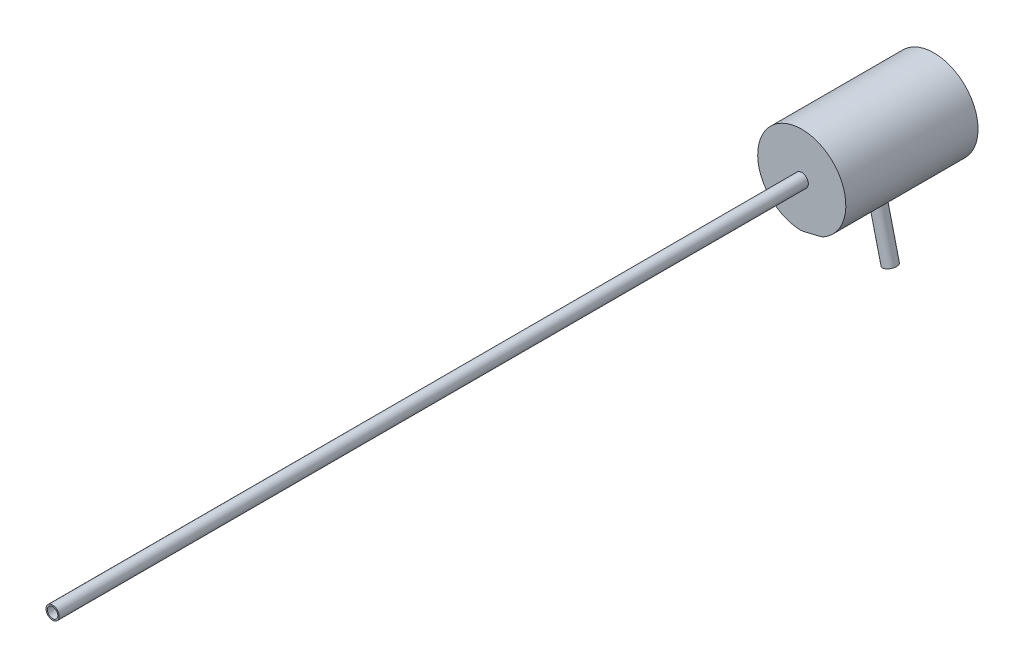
ISO-10303-21;
HEADER;
FILE_DESCRIPTION(('STEP AP214'),'2;1');
FILE_NAME('part.step','',(''),(''),'','','');
FILE_SCHEMA(('AUTOMOTIVE_DESIGN { 1 0 10303 214 1 1 1 1 }'));
ENDSEC;
DATA;
#1=APPLICATION_CONTEXT('core data for automotive mechanical design processes');
#2=APPLICATION_PROTOCOL_DEFINITION('international standard','automotive_design',2000,#1);
#3=PRODUCT_CONTEXT('',#1,'mechanical');
#4=PRODUCT('Part','Part','',(#3));
#5=PRODUCT_RELATED_PRODUCT_CATEGORY('part','',(#4));
#6=PRODUCT_DEFINITION_FORMATION('','',#4);
#7=PRODUCT_DEFINITION_CONTEXT('part definition',#1,'design');
#8=PRODUCT_DEFINITION('design','',#6,#7);
#9=PRODUCT_DEFINITION_SHAPE('','',#8);
#10=(LENGTH_UNIT() NAMED_UNIT(*) SI_UNIT(.MILLI.,.METRE.));
#11=(NAMED_UNIT(*) PLANE_ANGLE_UNIT() SI_UNIT($,.RADIAN.));
#12=(NAMED_UNIT(*) SI_UNIT($,.STERADIAN.) SOLID_ANGLE_UNIT());
#13=UNCERTAINTY_MEASURE_WITH_UNIT(LENGTH_MEASURE(1.E-05),#10,'distance_accuracy_value','');
#14=(GEOMETRIC_REPRESENTATION_CONTEXT(3) GLOBAL_UNCERTAINTY_ASSIGNED_CONTEXT((#13)) GLOBAL_UNIT_ASSIGNED_CONTEXT((#10,
#11,#12)) REPRESENTATION_CONTEXT('',''));
#15=CARTESIAN_POINT('',(0.,0.,0.));
#16=DIRECTION('',(0.,0.,1.));
#17=DIRECTION('',(1.,0.,0.));
#18=AXIS2_PLACEMENT_3D('',#15,#16,#17);
#19=CARTESIAN_POINT('',(0.,-12.7,101.6));
#20=DIRECTION('',(-0.234935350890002,0.972010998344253,0.));
#21=DIRECTION('',(-0.972010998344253,-0.234935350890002,0.));
#22=AXIS2_PLACEMENT_3D('',#19,#20,#21);
#23=PLANE('',#22);
#24=DIRECTION('',(0.972010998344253,0.234935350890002,0.));
#25=VECTOR('',#24,1.);
#26=CARTESIAN_POINT('',(0.,-12.7,0.));
#27=LINE('',#26,#25);
#28=CARTESIAN_POINT('',(0.664361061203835,-12.5394237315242,0.));
#29=VERTEX_POINT('',#28);
#30=CARTESIAN_POINT('',(5.13597646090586,-11.4586329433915,0.));
#31=VERTEX_POINT('',#30);
#32=EDGE_CURVE('E103',#29,#31,#27,.T.);
#33=ORIENTED_EDGE('',*,*,#32,.T.);
#34=DIRECTION('',(0.,0.,-1.));
#35=VECTOR('',#34,1.);
#36=CARTESIAN_POINT('',(5.13597646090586,-11.4586329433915,101.6));
#37=LINE('',#36,#35);
#38=CARTESIAN_POINT('',(5.13597646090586,-11.4586329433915,38.1));
#39=VERTEX_POINT('',#38);
#40=EDGE_CURVE('E52',#31,#39,#37,.F.);
#41=ORIENTED_EDGE('',*,*,#40,.T.);
#42=DIRECTION('',(-0.972010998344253,-0.234935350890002,0.));
#43=VECTOR('',#42,1.);
#44=CARTESIAN_POINT('',(2.90016876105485,-11.9990283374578,38.1));
#45=LINE('',#44,#43);
#46=CARTESIAN_POINT('',(0.664361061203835,-12.5394237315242,38.1));
#47=VERTEX_POINT('',#46);
#48=EDGE_CURVE('E74',#39,#47,#45,.T.);
#49=ORIENTED_EDGE('',*,*,#48,.T.);
#50=DIRECTION('',(0.,0.,-1.));
#51=VECTOR('',#50,1.);
#52=CARTESIAN_POINT('',(0.664361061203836,-12.5394237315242,101.6));
#53=LINE('',#52,#51);
#54=EDGE_CURVE('E97',#47,#29,#53,.T.);
#55=ORIENTED_EDGE('',*,*,#54,.T.);
#56=EDGE_LOOP('',(#33,#41,#49,#55));
#57=FACE_BOUND('',#56,.T.);
#58=CARTESIAN_POINT('',(2.90016876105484,-11.9990283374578,19.1835264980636));
#59=DIRECTION('',(-0.234935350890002,0.972010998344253,0.));
#60=DIRECTION('',(-0.972010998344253,-0.234935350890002,0.));
#61=AXIS2_PLACEMENT_3D('',#58,#59,#60);
#62=CIRCLE('',#61,1.905);
#63=CARTESIAN_POINT('',(1.04848780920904,-12.4465801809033,19.1835264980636));
#64=VERTEX_POINT('',#63);
#65=EDGE_CURVE('E92',#64,#64,#62,.F.);
#66=ORIENTED_EDGE('',*,*,#65,.F.);
#67=EDGE_LOOP('',(#66));
#68=FACE_BOUND('',#67,.T.);
#69=ADVANCED_FACE('F31',(#57,#68),#23,.F.);
#70=CARTESIAN_POINT('',(0.,0.,38.1));
#71=DIRECTION('',(0.,0.,1.));
#72=DIRECTION('',(1.,0.,0.));
#73=AXIS2_PLACEMENT_3D('',#70,#71,#72);
#74=PLANE('',#73);
#75=ORIENTED_EDGE('',*,*,#48,.F.);
#76=CARTESIAN_POINT('',(3.94250487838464,-6.52081707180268,38.1));
#77=DIRECTION('',(0.,0.,1.));
#78=DIRECTION('',(1.,0.,0.));
#79=AXIS2_PLACEMENT_3D('',#76,#77,#78);
#80=CIRCLE('',#79,5.08);
#81=CARTESIAN_POINT('',(6.57084146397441,-10.8680284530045,38.1));
#82=VERTEX_POINT('',#81);
#83=EDGE_CURVE('E11',#39,#82,#80,.T.);
#84=ORIENTED_EDGE('',*,*,#83,.T.);
#85=CARTESIAN_POINT('',(0.,0.,38.1));
#86=DIRECTION('',(0.,0.,1.));
#87=DIRECTION('',(1.,0.,0.));
#88=AXIS2_PLACEMENT_3D('',#85,#86,#87);
#89=CIRCLE('',#88,12.7);
#90=CARTESIAN_POINT('',(-0.881850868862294,-12.6693464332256,38.1));
#91=VERTEX_POINT('',#90);
#92=EDGE_CURVE('E73',#82,#91,#89,.T.);
#93=ORIENTED_EDGE('',*,*,#92,.T.);
#94=CARTESIAN_POINT('',(-0.529110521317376,-7.60160785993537,38.1));
#95=DIRECTION('',(0.,0.,1.));
#96=DIRECTION('',(1.,0.,0.));
#97=AXIS2_PLACEMENT_3D('',#94,#95,#96);
#98=CIRCLE('',#97,5.08);
#99=EDGE_CURVE('E39',#91,#47,#98,.T.);
#100=ORIENTED_EDGE('',*,*,#99,.T.);
#101=EDGE_LOOP('',(#75,#84,#93,#100));
#102=FACE_BOUND('',#101,.T.);
#103=CARTESIAN_POINT('',(0.,0.,38.1));
#104=DIRECTION('',(0.,0.,1.));
#105=DIRECTION('',(1.,0.,0.));
#106=AXIS2_PLACEMENT_3D('',#103,#104,#105);
#107=CIRCLE('',#106,1.905);
#108=CARTESIAN_POINT('',(1.905,0.,38.1));
#109=VERTEX_POINT('',#108);
#110=EDGE_CURVE('E118',#109,#109,#107,.T.);
#111=ORIENTED_EDGE('',*,*,#110,.F.);
#112=EDGE_LOOP('',(#111));
#113=FACE_BOUND('',#112,.T.);
#114=ADVANCED_FACE('F71',(#102,#113),#74,.T.);
#115=CARTESIAN_POINT('',(0.,0.,38.1));
#116=DIRECTION('',(0.,0.,-1.));
#117=DIRECTION('',(-1.,0.,0.));
#118=AXIS2_PLACEMENT_3D('',#115,#116,#117);
#119=CYLINDRICAL_SURFACE('',#118,12.7);
#120=ORIENTED_EDGE('',*,*,#92,.F.);
#121=DIRECTION('',(0.,0.,-1.));
#122=VECTOR('',#121,1.);
#123=CARTESIAN_POINT('',(6.57084146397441,-10.8680284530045,38.1));
#124=LINE('',#123,#122);
#125=CARTESIAN_POINT('',(6.57084146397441,-10.8680284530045,0.));
#126=VERTEX_POINT('',#125);
#127=EDGE_CURVE('E80',#82,#126,#124,.T.);
#128=ORIENTED_EDGE('',*,*,#127,.T.);
#129=CARTESIAN_POINT('',(0.,0.,0.));
#130=DIRECTION('',(0.,0.,1.));
#131=DIRECTION('',(1.,0.,0.));
#132=AXIS2_PLACEMENT_3D('',#129,#130,#131);
#133=CIRCLE('',#132,12.7);
#134=CARTESIAN_POINT('',(-0.881850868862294,-12.6693464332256,0.));
#135=VERTEX_POINT('',#134);
#136=EDGE_CURVE('E85',#126,#135,#133,.T.);
#137=ORIENTED_EDGE('',*,*,#136,.T.);
#138=DIRECTION('',(0.,0.,-1.));
#139=VECTOR('',#138,1.);
#140=CARTESIAN_POINT('',(-0.881850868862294,-12.6693464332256,38.1));
#141=LINE('',#140,#139);
#142=EDGE_CURVE('E83',#135,#91,#141,.F.);
#143=ORIENTED_EDGE('',*,*,#142,.T.);
#144=EDGE_LOOP('',(#120,#128,#137,#143));
#145=FACE_BOUND('',#144,.T.);
#146=ADVANCED_FACE('F33',(#145),#119,.T.);
#147=CARTESIAN_POINT('',(0.,0.,0.));
#148=DIRECTION('',(0.,0.,1.));
#149=DIRECTION('',(1.,0.,0.));
#150=AXIS2_PLACEMENT_3D('',#147,#148,#149);
#151=PLANE('',#150);
#152=ORIENTED_EDGE('',*,*,#136,.F.);
#153=CARTESIAN_POINT('',(3.94250487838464,-6.52081707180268,0.));
#154=DIRECTION('',(0.,0.,1.));
#155=DIRECTION('',(1.,0.,0.));
#156=AXIS2_PLACEMENT_3D('',#153,#154,#155);
#157=CIRCLE('',#156,5.08);
#158=EDGE_CURVE('E88',#126,#31,#157,.F.);
#159=ORIENTED_EDGE('',*,*,#158,.T.);
#160=ORIENTED_EDGE('',*,*,#32,.F.);
#161=CARTESIAN_POINT('',(-0.529110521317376,-7.60160785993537,0.));
#162=DIRECTION('',(0.,0.,1.));
#163=DIRECTION('',(1.,0.,0.));
#164=AXIS2_PLACEMENT_3D('',#161,#162,#163);
#165=CIRCLE('',#164,5.08);
#166=EDGE_CURVE('E89',#29,#135,#165,.F.);
#167=ORIENTED_EDGE('',*,*,#166,.T.);
#168=EDGE_LOOP('',(#152,#159,#160,#167));
#169=FACE_BOUND('',#168,.T.);
#170=ADVANCED_FACE('F106',(#169),#151,.F.);
#171=CARTESIAN_POINT('',(0.,0.,254.));
#172=DIRECTION('',(0.,0.,1.));
#173=DIRECTION('',(1.,0.,0.));
#174=AXIS2_PLACEMENT_3D('',#171,#172,#173);
#175=PLANE('',#174);
#176=CARTESIAN_POINT('',(0.,0.,254.));
#177=DIRECTION('',(0.,0.,1.));
#178=DIRECTION('',(1.,0.,0.));
#179=AXIS2_PLACEMENT_3D('',#176,#177,#178);
#180=CIRCLE('',#179,1.905);
#181=CARTESIAN_POINT('',(1.905,0.,254.));
#182=VERTEX_POINT('',#181);
#183=EDGE_CURVE('E121',#182,#182,#180,.T.);
#184=ORIENTED_EDGE('',*,*,#183,.T.);
#185=EDGE_LOOP('',(#184));
#186=FACE_BOUND('',#185,.T.);
#187=CARTESIAN_POINT('',(0.,0.,254.));
#188=DIRECTION('',(0.,0.,1.));
#189=DIRECTION('',(1.,0.,0.));
#190=AXIS2_PLACEMENT_3D('',#187,#188,#189);
#191=CIRCLE('',#190,1.50374643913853);
#192=CARTESIAN_POINT('',(1.50374643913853,0.,254.));
#193=VERTEX_POINT('',#192);
#194=EDGE_CURVE('E109',#193,#193,#191,.T.);
#195=ORIENTED_EDGE('',*,*,#194,.F.);
#196=EDGE_LOOP('',(#195));
#197=FACE_BOUND('',#196,.T.);
#198=ADVANCED_FACE('F187',(#186,#197),#175,.T.);
#199=CARTESIAN_POINT('',(0.,0.,254.));
#200=DIRECTION('',(0.,0.,-1.));
#201=DIRECTION('',(-1.,0.,0.));
#202=AXIS2_PLACEMENT_3D('',#199,#200,#201);
#203=CYLINDRICAL_SURFACE('',#202,1.905);
#204=ORIENTED_EDGE('',*,*,#183,.F.);
#205=EDGE_LOOP('',(#204));
#206=FACE_BOUND('',#205,.T.);
#207=ORIENTED_EDGE('',*,*,#110,.T.);
#208=EDGE_LOOP('',(#207));
#209=FACE_BOUND('',#208,.T.);
#210=ADVANCED_FACE('F240',(#206,#209),#203,.T.);
#211=CARTESIAN_POINT('',(0.,0.,254.));
#212=DIRECTION('',(0.,0.,-1.));
#213=DIRECTION('',(-1.,0.,0.));
#214=AXIS2_PLACEMENT_3D('',#211,#212,#213);
#215=CYLINDRICAL_SURFACE('',#214,1.50374643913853);
#216=ORIENTED_EDGE('',*,*,#194,.T.);
#217=EDGE_LOOP('',(#216));
#218=FACE_BOUND('',#217,.T.);
#219=CARTESIAN_POINT('',(0.,0.,38.1));
#220=DIRECTION('',(0.,0.,1.));
#221=DIRECTION('',(1.,0.,0.));
#222=AXIS2_PLACEMENT_3D('',#219,#220,#221);
#223=CIRCLE('',#222,1.50374643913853);
#224=CARTESIAN_POINT('',(1.50374643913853,0.,38.1));
#225=VERTEX_POINT('',#224);
#226=EDGE_CURVE('E84',#225,#225,#223,.F.);
#227=ORIENTED_EDGE('',*,*,#226,.T.);
#228=EDGE_LOOP('',(#227));
#229=FACE_BOUND('',#228,.T.);
#230=ADVANCED_FACE('F167',(#218,#229),#215,.F.);
#231=ORIENTED_EDGE('',*,*,#226,.F.);
#232=EDGE_LOOP('',(#231));
#233=FACE_BOUND('',#232,.T.);
#234=ADVANCED_FACE('F136',(#233),#74,.T.);
#235=CARTESIAN_POINT('',(6.59247146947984,-27.2753961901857,19.1835264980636));
#236=DIRECTION('',(0.234935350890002,-0.972010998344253,0.));
#237=DIRECTION('',(0.972010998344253,0.234935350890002,0.));
#238=AXIS2_PLACEMENT_3D('',#235,#236,#237);
#239=PLANE('',#238);
#240=CARTESIAN_POINT('',(6.59247146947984,-27.2753961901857,19.1835264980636));
#241=DIRECTION('',(0.234935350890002,-0.972010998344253,0.));
#242=DIRECTION('',(0.972010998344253,0.234935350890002,0.));
#243=AXIS2_PLACEMENT_3D('',#240,#241,#242);
#244=CIRCLE('',#243,1.905);
#245=CARTESIAN_POINT('',(8.44415242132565,-26.8278443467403,19.1835264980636));
#246=VERTEX_POINT('',#245);
#247=EDGE_CURVE('E107',#246,#246,#244,.T.);
#248=ORIENTED_EDGE('',*,*,#247,.T.);
#249=EDGE_LOOP('',(#248));
#250=FACE_BOUND('',#249,.T.);
#251=CARTESIAN_POINT('',(6.59247146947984,-27.2753961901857,19.1835264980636));
#252=DIRECTION('',(0.234935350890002,-0.972010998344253,0.));
#253=DIRECTION('',(0.972010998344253,0.234935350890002,0.));
#254=AXIS2_PLACEMENT_3D('',#251,#252,#253);
#255=CIRCLE('',#254,1.53595750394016);
#256=CARTESIAN_POINT('',(8.08543905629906,-26.9145454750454,19.1835264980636));
#257=VERTEX_POINT('',#256);
#258=EDGE_CURVE('E112',#257,#257,#255,.T.);
#259=ORIENTED_EDGE('',*,*,#258,.F.);
#260=EDGE_LOOP('',(#259));
#261=FACE_BOUND('',#260,.T.);
#262=ADVANCED_FACE('F158',(#250,#261),#239,.T.);
#263=CARTESIAN_POINT('',(6.59247146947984,-27.2753961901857,19.1835264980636));
#264=DIRECTION('',(-0.234935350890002,0.972010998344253,0.));
#265=DIRECTION('',(-0.972010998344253,-0.234935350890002,0.));
#266=AXIS2_PLACEMENT_3D('',#263,#264,#265);
#267=CYLINDRICAL_SURFACE('',#266,1.905);
#268=ORIENTED_EDGE('',*,*,#247,.F.);
#269=EDGE_LOOP('',(#268));
#270=FACE_BOUND('',#269,.T.);
#271=ORIENTED_EDGE('',*,*,#65,.T.);
#272=EDGE_LOOP('',(#271));
#273=FACE_BOUND('',#272,.T.);
#274=ADVANCED_FACE('F129',(#270,#273),#267,.T.);
#275=CARTESIAN_POINT('',(6.59247146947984,-27.2753961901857,19.1835264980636));
#276=DIRECTION('',(-0.234935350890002,0.972010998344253,0.));
#277=DIRECTION('',(-0.972010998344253,-0.234935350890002,0.));
#278=AXIS2_PLACEMENT_3D('',#275,#276,#277);
#279=CYLINDRICAL_SURFACE('',#278,1.53595750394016);
#280=ORIENTED_EDGE('',*,*,#258,.T.);
#281=EDGE_LOOP('',(#280));
#282=FACE_BOUND('',#281,.T.);
#283=CARTESIAN_POINT('',(2.90016876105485,-11.9990283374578,19.1835264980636));
#284=DIRECTION('',(0.234935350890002,-0.972010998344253,0.));
#285=DIRECTION('',(0.972010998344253,0.234935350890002,0.));
#286=AXIS2_PLACEMENT_3D('',#283,#284,#285);
#287=CIRCLE('',#286,1.53595750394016);
#288=CARTESIAN_POINT('',(4.39313634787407,-11.6381776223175,19.1835264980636));
#289=VERTEX_POINT('',#288);
#290=EDGE_CURVE('E152',#289,#289,#287,.T.);
#291=ORIENTED_EDGE('',*,*,#290,.F.);
#292=EDGE_LOOP('',(#291));
#293=FACE_BOUND('',#292,.T.);
#294=ADVANCED_FACE('F140',(#282,#293),#279,.F.);
#295=ORIENTED_EDGE('',*,*,#290,.T.);
#296=EDGE_LOOP('',(#295));
#297=FACE_BOUND('',#296,.T.);
#298=ADVANCED_FACE('F132',(#297),#23,.F.);
#299=CARTESIAN_POINT('',(3.94250487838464,-6.52081707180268,38.1));
#300=DIRECTION('',(0.,0.,-1.));
#301=DIRECTION('',(-1.,0.,0.));
#302=AXIS2_PLACEMENT_3D('',#299,#300,#301);
#303=CYLINDRICAL_SURFACE('',#302,5.08);
#304=ORIENTED_EDGE('',*,*,#83,.F.);
#305=ORIENTED_EDGE('',*,*,#40,.F.);
#306=ORIENTED_EDGE('',*,*,#158,.F.);
#307=ORIENTED_EDGE('',*,*,#127,.F.);
#308=EDGE_LOOP('',(#304,#305,#306,#307));
#309=FACE_BOUND('',#308,.T.);
#310=ADVANCED_FACE('F87',(#309),#303,.T.);
#311=CARTESIAN_POINT('',(-0.529110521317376,-7.60160785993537,38.1));
#312=DIRECTION('',(0.,0.,-1.));
#313=DIRECTION('',(-1.,0.,0.));
#314=AXIS2_PLACEMENT_3D('',#311,#312,#313);
#315=CYLINDRICAL_SURFACE('',#314,5.08);
#316=ORIENTED_EDGE('',*,*,#99,.F.);
#317=ORIENTED_EDGE('',*,*,#142,.F.);
#318=ORIENTED_EDGE('',*,*,#166,.F.);
#319=ORIENTED_EDGE('',*,*,#54,.F.);
#320=EDGE_LOOP('',(#316,#317,#318,#319));
#321=FACE_BOUND('',#320,.T.);
#322=ADVANCED_FACE('F146',(#321),#315,.T.);
#323=CLOSED_SHELL('',(#69,#114,#146,#170,#198,#210,#230,#234,#262,#274,#294,#298,#310,#322));
#324=MANIFOLD_SOLID_BREP('B2',#323);
#325=ADVANCED_BREP_SHAPE_REPRESENTATION('',(#18,#324),#14);
#326=SHAPE_DEFINITION_REPRESENTATION(#9,#325);
ENDSEC;
END-ISO-10303-21;
